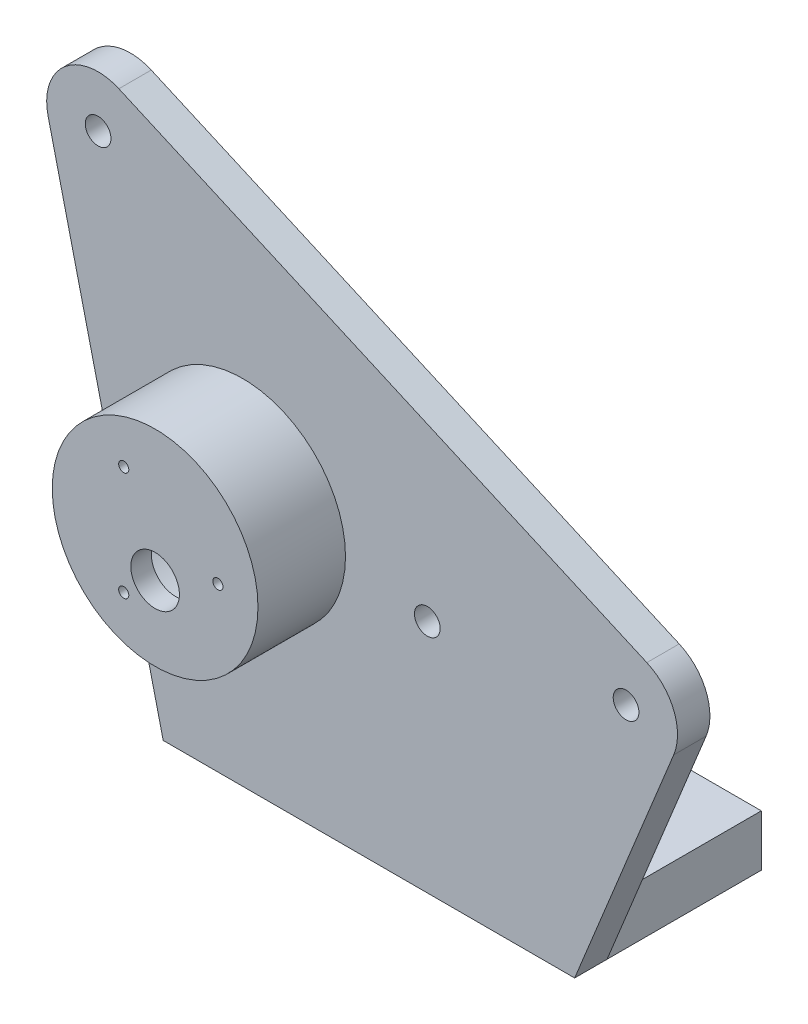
ISO-10303-21;
HEADER;
FILE_DESCRIPTION(('STEP AP214'),'2;1');
FILE_NAME('part.step','',(''),(''),'','','');
FILE_SCHEMA(('AUTOMOTIVE_DESIGN { 1 0 10303 214 1 1 1 1 }'));
ENDSEC;
DATA;
#1=APPLICATION_CONTEXT('core data for automotive mechanical design processes');
#2=APPLICATION_PROTOCOL_DEFINITION('international standard','automotive_design',2000,#1);
#3=PRODUCT_CONTEXT('',#1,'mechanical');
#4=PRODUCT('Part','Part','',(#3));
#5=PRODUCT_RELATED_PRODUCT_CATEGORY('part','',(#4));
#6=PRODUCT_DEFINITION_FORMATION('','',#4);
#7=PRODUCT_DEFINITION_CONTEXT('part definition',#1,'design');
#8=PRODUCT_DEFINITION('design','',#6,#7);
#9=PRODUCT_DEFINITION_SHAPE('','',#8);
#10=(LENGTH_UNIT() NAMED_UNIT(*) SI_UNIT(.MILLI.,.METRE.));
#11=(NAMED_UNIT(*) PLANE_ANGLE_UNIT() SI_UNIT($,.RADIAN.));
#12=(NAMED_UNIT(*) SI_UNIT($,.STERADIAN.) SOLID_ANGLE_UNIT());
#13=UNCERTAINTY_MEASURE_WITH_UNIT(LENGTH_MEASURE(1.E-05),#10,'distance_accuracy_value','');
#14=(GEOMETRIC_REPRESENTATION_CONTEXT(3) GLOBAL_UNCERTAINTY_ASSIGNED_CONTEXT((#13)) GLOBAL_UNIT_ASSIGNED_CONTEXT((#10,
#11,#12)) REPRESENTATION_CONTEXT('',''));
#15=CARTESIAN_POINT('',(0.,0.,0.));
#16=DIRECTION('',(0.,0.,1.));
#17=DIRECTION('',(1.,0.,0.));
#18=AXIS2_PLACEMENT_3D('',#15,#16,#17);
#19=CARTESIAN_POINT('',(0.,0.,-4.));
#20=DIRECTION('',(0.,0.,1.));
#21=DIRECTION('',(1.,0.,0.));
#22=AXIS2_PLACEMENT_3D('',#19,#20,#21);
#23=PLANE('',#22);
#24=CARTESIAN_POINT('',(-49.0816991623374,-6.64888767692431,-4.));
#25=DIRECTION('',(0.,0.,-1.));
#26=DIRECTION('',(-1.,0.,0.));
#27=AXIS2_PLACEMENT_3D('',#24,#25,#26);
#28=CIRCLE('',#27,3.1749999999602);
#29=CARTESIAN_POINT('',(-52.2566991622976,-6.64888767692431,-4.));
#30=VERTEX_POINT('',#29);
#31=EDGE_CURVE('E223',#30,#30,#28,.T.);
#32=ORIENTED_EDGE('',*,*,#31,.F.);
#33=EDGE_LOOP('',(#32));
#34=FACE_BOUND('',#33,.T.);
#35=CARTESIAN_POINT('',(-94.6851515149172,-2.91133055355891,-4.));
#36=DIRECTION('',(0.,0.,-1.));
#37=DIRECTION('',(-1.,0.,0.));
#38=AXIS2_PLACEMENT_3D('',#35,#36,#37);
#39=CIRCLE('',#38,20.32);
#40=CARTESIAN_POINT('',(-115.005151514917,-2.91133055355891,-4.));
#41=VERTEX_POINT('',#40);
#42=EDGE_CURVE('E220',#41,#41,#39,.T.);
#43=ORIENTED_EDGE('',*,*,#42,.F.);
#44=EDGE_LOOP('',(#43));
#45=FACE_BOUND('',#44,.T.);
#46=CARTESIAN_POINT('',(0.,0.,-4.));
#47=DIRECTION('',(0.,0.,1.));
#48=DIRECTION('',(1.,0.,0.));
#49=AXIS2_PLACEMENT_3D('',#46,#47,#48);
#50=CIRCLE('',#49,3.175);
#51=CARTESIAN_POINT('',(3.175,0.,-4.));
#52=VERTEX_POINT('',#51);
#53=EDGE_CURVE('E186',#52,#52,#50,.T.);
#54=ORIENTED_EDGE('',*,*,#53,.T.);
#55=EDGE_LOOP('',(#54));
#56=FACE_BOUND('',#55,.T.);
#57=CARTESIAN_POINT('',(-130.3782,57.531,-4.));
#58=DIRECTION('',(0.,0.,1.));
#59=DIRECTION('',(1.,0.,0.));
#60=AXIS2_PLACEMENT_3D('',#57,#58,#59);
#61=CIRCLE('',#60,3.175);
#62=CARTESIAN_POINT('',(-127.2032,57.531,-4.));
#63=VERTEX_POINT('',#62);
#64=EDGE_CURVE('E180',#63,#63,#61,.T.);
#65=ORIENTED_EDGE('',*,*,#64,.T.);
#66=EDGE_LOOP('',(#65));
#67=FACE_BOUND('',#66,.T.);
#68=DIRECTION('',(0.,-1.,0.));
#69=VECTOR('',#68,1.);
#70=CARTESIAN_POINT('',(-12.7,-64.7446,-4.));
#71=LINE('',#70,#69);
#72=CARTESIAN_POINT('',(-12.7,-52.0446,-4.));
#73=VERTEX_POINT('',#72);
#74=CARTESIAN_POINT('',(-12.7,-64.7446,-4.));
#75=VERTEX_POINT('',#74);
#76=EDGE_CURVE('E69',#73,#75,#71,.T.);
#77=ORIENTED_EDGE('',*,*,#76,.F.);
#78=DIRECTION('',(1.,0.,0.));
#79=VECTOR('',#78,1.);
#80=CARTESIAN_POINT('',(-12.7,-52.0446,-4.));
#81=LINE('',#80,#79);
#82=CARTESIAN_POINT('',(-114.3,-52.0446,-4.));
#83=VERTEX_POINT('',#82);
#84=EDGE_CURVE('E202',#83,#73,#81,.T.);
#85=ORIENTED_EDGE('',*,*,#84,.F.);
#86=DIRECTION('',(0.,1.,0.));
#87=VECTOR('',#86,1.);
#88=CARTESIAN_POINT('',(-114.3,-64.7446,-4.));
#89=LINE('',#88,#87);
#90=CARTESIAN_POINT('',(-114.3,-64.7446,-4.));
#91=VERTEX_POINT('',#90);
#92=EDGE_CURVE('E205',#91,#83,#89,.T.);
#93=ORIENTED_EDGE('',*,*,#92,.F.);
#94=DIRECTION('',(0.231774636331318,-0.972769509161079,0.));
#95=VECTOR('',#94,1.);
#96=CARTESIAN_POINT('',(-142.732372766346,54.5874621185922,-4.));
#97=LINE('',#96,#95);
#98=CARTESIAN_POINT('',(-142.732372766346,54.5874621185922,-4.));
#99=VERTEX_POINT('',#98);
#100=EDGE_CURVE('E140',#99,#91,#97,.T.);
#101=ORIENTED_EDGE('',*,*,#100,.F.);
#102=CARTESIAN_POINT('',(-130.3782,57.531,-4.));
#103=DIRECTION('',(0.,0.,1.));
#104=DIRECTION('',(1.,0.,0.));
#105=AXIS2_PLACEMENT_3D('',#102,#103,#104);
#106=CIRCLE('',#105,12.7);
#107=CARTESIAN_POINT('',(-125.25113344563,69.1500872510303,-4.));
#108=VERTEX_POINT('',#107);
#109=EDGE_CURVE('E160',#108,#99,#106,.T.);
#110=ORIENTED_EDGE('',*,*,#109,.F.);
#111=DIRECTION('',(-0.914888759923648,0.403706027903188,0.));
#112=VECTOR('',#111,1.);
#113=CARTESIAN_POINT('',(5.12706655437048,11.6190872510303,-4.));
#114=LINE('',#113,#112);
#115=CARTESIAN_POINT('',(5.12706655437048,11.6190872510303,-4.));
#116=VERTEX_POINT('',#115);
#117=EDGE_CURVE('E157',#116,#108,#114,.T.);
#118=ORIENTED_EDGE('',*,*,#117,.F.);
#119=CARTESIAN_POINT('',(0.,0.,-4.));
#120=DIRECTION('',(0.,0.,1.));
#121=DIRECTION('',(1.,0.,0.));
#122=AXIS2_PLACEMENT_3D('',#119,#120,#121);
#123=CIRCLE('',#122,12.7);
#124=CARTESIAN_POINT('',(11.75889689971,-4.79774360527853,-4.));
#125=VERTEX_POINT('',#124);
#126=EDGE_CURVE('E154',#125,#116,#123,.T.);
#127=ORIENTED_EDGE('',*,*,#126,.F.);
#128=DIRECTION('',(0.377775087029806,0.925897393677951,0.));
#129=VECTOR('',#128,1.);
#130=CARTESIAN_POINT('',(-12.7,-64.7446,-4.));
#131=LINE('',#130,#129);
#132=EDGE_CURVE('E103',#75,#125,#131,.T.);
#133=ORIENTED_EDGE('',*,*,#132,.F.);
#134=EDGE_LOOP('',(#77,#85,#93,#101,#110,#118,#127,#133));
#135=FACE_BOUND('',#134,.T.);
#136=ADVANCED_FACE('F53',(#34,#45,#56,#67,#135),#23,.F.);
#137=CARTESIAN_POINT('',(0.,0.,4.));
#138=DIRECTION('',(0.,0.,1.));
#139=DIRECTION('',(1.,0.,0.));
#140=AXIS2_PLACEMENT_3D('',#137,#138,#139);
#141=PLANE('',#140);
#142=CARTESIAN_POINT('',(-94.6851515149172,-2.91133055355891,4.));
#143=DIRECTION('',(0.,0.,1.));
#144=DIRECTION('',(1.,0.,0.));
#145=AXIS2_PLACEMENT_3D('',#142,#143,#144);
#146=CIRCLE('',#145,25.4);
#147=CARTESIAN_POINT('',(-69.2851515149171,-2.91133055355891,4.));
#148=VERTEX_POINT('',#147);
#149=EDGE_CURVE('E13',#148,#148,#146,.T.);
#150=ORIENTED_EDGE('',*,*,#149,.F.);
#151=EDGE_LOOP('',(#150));
#152=FACE_BOUND('',#151,.T.);
#153=CARTESIAN_POINT('',(-49.0816991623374,-6.64888767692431,4.));
#154=DIRECTION('',(0.,0.,1.));
#155=DIRECTION('',(1.,0.,0.));
#156=AXIS2_PLACEMENT_3D('',#153,#154,#155);
#157=CIRCLE('',#156,3.1749999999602);
#158=CARTESIAN_POINT('',(-45.9066991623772,-6.64888767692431,4.));
#159=VERTEX_POINT('',#158);
#160=EDGE_CURVE('E209',#159,#159,#157,.F.);
#161=ORIENTED_EDGE('',*,*,#160,.T.);
#162=EDGE_LOOP('',(#161));
#163=FACE_BOUND('',#162,.T.);
#164=CARTESIAN_POINT('',(-130.3782,57.531,4.));
#165=DIRECTION('',(0.,0.,1.));
#166=DIRECTION('',(1.,0.,0.));
#167=AXIS2_PLACEMENT_3D('',#164,#165,#166);
#168=CIRCLE('',#167,3.175);
#169=CARTESIAN_POINT('',(-127.2032,57.531,4.));
#170=VERTEX_POINT('',#169);
#171=EDGE_CURVE('E158',#170,#170,#168,.T.);
#172=ORIENTED_EDGE('',*,*,#171,.F.);
#173=EDGE_LOOP('',(#172));
#174=FACE_BOUND('',#173,.T.);
#175=CARTESIAN_POINT('',(0.,0.,4.));
#176=DIRECTION('',(0.,0.,1.));
#177=DIRECTION('',(1.,0.,0.));
#178=AXIS2_PLACEMENT_3D('',#175,#176,#177);
#179=CIRCLE('',#178,12.7);
#180=CARTESIAN_POINT('',(11.75889689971,-4.79774360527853,4.));
#181=VERTEX_POINT('',#180);
#182=CARTESIAN_POINT('',(5.12706655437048,11.6190872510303,4.));
#183=VERTEX_POINT('',#182);
#184=EDGE_CURVE('E164',#181,#183,#179,.T.);
#185=ORIENTED_EDGE('',*,*,#184,.T.);
#186=DIRECTION('',(-0.914888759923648,0.403706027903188,0.));
#187=VECTOR('',#186,1.);
#188=CARTESIAN_POINT('',(5.12706655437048,11.6190872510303,4.));
#189=LINE('',#188,#187);
#190=CARTESIAN_POINT('',(-125.25113344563,69.1500872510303,4.));
#191=VERTEX_POINT('',#190);
#192=EDGE_CURVE('E112',#183,#191,#189,.T.);
#193=ORIENTED_EDGE('',*,*,#192,.T.);
#194=CARTESIAN_POINT('',(-130.3782,57.531,4.));
#195=DIRECTION('',(0.,0.,1.));
#196=DIRECTION('',(1.,0.,0.));
#197=AXIS2_PLACEMENT_3D('',#194,#195,#196);
#198=CIRCLE('',#197,12.7);
#199=CARTESIAN_POINT('',(-142.732372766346,54.5874621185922,4.));
#200=VERTEX_POINT('',#199);
#201=EDGE_CURVE('E130',#191,#200,#198,.T.);
#202=ORIENTED_EDGE('',*,*,#201,.T.);
#203=DIRECTION('',(0.231774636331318,-0.972769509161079,0.));
#204=VECTOR('',#203,1.);
#205=CARTESIAN_POINT('',(-142.732372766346,54.5874621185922,4.));
#206=LINE('',#205,#204);
#207=CARTESIAN_POINT('',(-114.3,-64.7446,4.));
#208=VERTEX_POINT('',#207);
#209=EDGE_CURVE('E122',#200,#208,#206,.T.);
#210=ORIENTED_EDGE('',*,*,#209,.T.);
#211=DIRECTION('',(1.,0.,0.));
#212=VECTOR('',#211,1.);
#213=CARTESIAN_POINT('',(-114.3,-64.7446,4.));
#214=LINE('',#213,#212);
#215=CARTESIAN_POINT('',(-12.7,-64.7446,4.));
#216=VERTEX_POINT('',#215);
#217=EDGE_CURVE('E127',#208,#216,#214,.T.);
#218=ORIENTED_EDGE('',*,*,#217,.T.);
#219=DIRECTION('',(0.377775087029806,0.925897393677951,0.));
#220=VECTOR('',#219,1.);
#221=CARTESIAN_POINT('',(-12.7,-64.7446,4.));
#222=LINE('',#221,#220);
#223=EDGE_CURVE('E78',#216,#181,#222,.T.);
#224=ORIENTED_EDGE('',*,*,#223,.T.);
#225=EDGE_LOOP('',(#185,#193,#202,#210,#218,#224));
#226=FACE_BOUND('',#225,.T.);
#227=CARTESIAN_POINT('',(0.,0.,4.));
#228=DIRECTION('',(0.,0.,1.));
#229=DIRECTION('',(1.,0.,0.));
#230=AXIS2_PLACEMENT_3D('',#227,#228,#229);
#231=CIRCLE('',#230,3.175);
#232=CARTESIAN_POINT('',(3.175,0.,4.));
#233=VERTEX_POINT('',#232);
#234=EDGE_CURVE('E183',#233,#233,#231,.T.);
#235=ORIENTED_EDGE('',*,*,#234,.F.);
#236=EDGE_LOOP('',(#235));
#237=FACE_BOUND('',#236,.T.);
#238=ADVANCED_FACE('F124',(#152,#163,#174,#226,#237),#141,.T.);
#239=CARTESIAN_POINT('',(0.,0.,4.));
#240=DIRECTION('',(0.,0.,-1.));
#241=DIRECTION('',(-1.,0.,0.));
#242=AXIS2_PLACEMENT_3D('',#239,#240,#241);
#243=CYLINDRICAL_SURFACE('',#242,12.7);
#244=ORIENTED_EDGE('',*,*,#126,.T.);
#245=DIRECTION('',(0.,0.,-1.));
#246=VECTOR('',#245,1.);
#247=CARTESIAN_POINT('',(5.12706655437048,11.6190872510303,4.));
#248=LINE('',#247,#246);
#249=EDGE_CURVE('E57',#183,#116,#248,.T.);
#250=ORIENTED_EDGE('',*,*,#249,.F.);
#251=ORIENTED_EDGE('',*,*,#184,.F.);
#252=DIRECTION('',(0.,0.,-1.));
#253=VECTOR('',#252,1.);
#254=CARTESIAN_POINT('',(11.75889689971,-4.79774360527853,4.));
#255=LINE('',#254,#253);
#256=EDGE_CURVE('E150',#181,#125,#255,.T.);
#257=ORIENTED_EDGE('',*,*,#256,.T.);
#258=EDGE_LOOP('',(#244,#250,#251,#257));
#259=FACE_BOUND('',#258,.T.);
#260=ADVANCED_FACE('F55',(#259),#243,.T.);
#261=CARTESIAN_POINT('',(5.12706655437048,11.6190872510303,4.));
#262=DIRECTION('',(-0.403706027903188,-0.914888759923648,0.));
#263=DIRECTION('',(0.914888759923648,-0.403706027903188,0.));
#264=AXIS2_PLACEMENT_3D('',#261,#262,#263);
#265=PLANE('',#264);
#266=ORIENTED_EDGE('',*,*,#117,.T.);
#267=DIRECTION('',(0.,0.,-1.));
#268=VECTOR('',#267,1.);
#269=CARTESIAN_POINT('',(-125.25113344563,69.1500872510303,4.));
#270=LINE('',#269,#268);
#271=EDGE_CURVE('E167',#191,#108,#270,.T.);
#272=ORIENTED_EDGE('',*,*,#271,.F.);
#273=ORIENTED_EDGE('',*,*,#192,.F.);
#274=ORIENTED_EDGE('',*,*,#249,.T.);
#275=EDGE_LOOP('',(#266,#272,#273,#274));
#276=FACE_BOUND('',#275,.T.);
#277=ADVANCED_FACE('F172',(#276),#265,.F.);
#278=CARTESIAN_POINT('',(-130.3782,57.531,4.));
#279=DIRECTION('',(0.,0.,-1.));
#280=DIRECTION('',(-1.,0.,0.));
#281=AXIS2_PLACEMENT_3D('',#278,#279,#280);
#282=CYLINDRICAL_SURFACE('',#281,12.7);
#283=ORIENTED_EDGE('',*,*,#109,.T.);
#284=DIRECTION('',(0.,0.,-1.));
#285=VECTOR('',#284,1.);
#286=CARTESIAN_POINT('',(-142.732372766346,54.5874621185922,4.));
#287=LINE('',#286,#285);
#288=EDGE_CURVE('E144',#200,#99,#287,.T.);
#289=ORIENTED_EDGE('',*,*,#288,.F.);
#290=ORIENTED_EDGE('',*,*,#201,.F.);
#291=ORIENTED_EDGE('',*,*,#271,.T.);
#292=EDGE_LOOP('',(#283,#289,#290,#291));
#293=FACE_BOUND('',#292,.T.);
#294=ADVANCED_FACE('F176',(#293),#282,.T.);
#295=CARTESIAN_POINT('',(-142.732372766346,54.5874621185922,4.));
#296=DIRECTION('',(0.972769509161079,0.231774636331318,0.));
#297=DIRECTION('',(-0.231774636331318,0.972769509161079,0.));
#298=AXIS2_PLACEMENT_3D('',#295,#296,#297);
#299=PLANE('',#298);
#300=ORIENTED_EDGE('',*,*,#100,.T.);
#301=DIRECTION('',(0.,0.,-1.));
#302=VECTOR('',#301,1.);
#303=CARTESIAN_POINT('',(-114.3,-64.7446,4.));
#304=LINE('',#303,#302);
#305=EDGE_CURVE('E137',#208,#91,#304,.T.);
#306=ORIENTED_EDGE('',*,*,#305,.F.);
#307=ORIENTED_EDGE('',*,*,#209,.F.);
#308=ORIENTED_EDGE('',*,*,#288,.T.);
#309=EDGE_LOOP('',(#300,#306,#307,#308));
#310=FACE_BOUND('',#309,.T.);
#311=ADVANCED_FACE('F138',(#310),#299,.F.);
#312=CARTESIAN_POINT('',(-114.3,-64.7446,4.));
#313=DIRECTION('',(0.,1.,0.));
#314=DIRECTION('',(-1.,0.,0.));
#315=AXIS2_PLACEMENT_3D('',#312,#313,#314);
#316=PLANE('',#315);
#317=CARTESIAN_POINT('',(-19.304,-64.7446,-8.572));
#318=DIRECTION('',(0.,-1.,0.));
#319=DIRECTION('',(1.,0.,0.));
#320=AXIS2_PLACEMENT_3D('',#317,#318,#319);
#321=CIRCLE('',#320,2.54000000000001);
#322=CARTESIAN_POINT('',(-16.764,-64.7446,-8.572));
#323=VERTEX_POINT('',#322);
#324=EDGE_CURVE('E262',#323,#323,#321,.T.);
#325=ORIENTED_EDGE('',*,*,#324,.F.);
#326=EDGE_LOOP('',(#325));
#327=FACE_BOUND('',#326,.T.);
#328=CARTESIAN_POINT('',(-44.196,-64.7446,-33.464));
#329=DIRECTION('',(0.,-1.,0.));
#330=DIRECTION('',(1.,0.,0.));
#331=AXIS2_PLACEMENT_3D('',#328,#329,#330);
#332=CIRCLE('',#331,2.53999999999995);
#333=CARTESIAN_POINT('',(-41.656,-64.7446,-33.464));
#334=VERTEX_POINT('',#333);
#335=EDGE_CURVE('E263',#334,#334,#332,.T.);
#336=ORIENTED_EDGE('',*,*,#335,.F.);
#337=EDGE_LOOP('',(#336));
#338=FACE_BOUND('',#337,.T.);
#339=ORIENTED_EDGE('',*,*,#305,.T.);
#340=DIRECTION('',(0.,0.,1.));
#341=VECTOR('',#340,1.);
#342=CARTESIAN_POINT('',(-114.3,-64.7446,-42.1));
#343=LINE('',#342,#341);
#344=CARTESIAN_POINT('',(-114.3,-64.7446,-42.1));
#345=VERTEX_POINT('',#344);
#346=EDGE_CURVE('E193',#345,#91,#343,.T.);
#347=ORIENTED_EDGE('',*,*,#346,.F.);
#348=DIRECTION('',(-1.,0.,0.));
#349=VECTOR('',#348,1.);
#350=CARTESIAN_POINT('',(-12.7,-64.7446,-42.1));
#351=LINE('',#350,#349);
#352=CARTESIAN_POINT('',(-12.7,-64.7446,-42.1));
#353=VERTEX_POINT('',#352);
#354=EDGE_CURVE('E215',#353,#345,#351,.T.);
#355=ORIENTED_EDGE('',*,*,#354,.F.);
#356=DIRECTION('',(0.,0.,1.));
#357=VECTOR('',#356,1.);
#358=CARTESIAN_POINT('',(-12.7,-64.7446,-42.1));
#359=LINE('',#358,#357);
#360=EDGE_CURVE('E189',#353,#75,#359,.T.);
#361=ORIENTED_EDGE('',*,*,#360,.T.);
#362=DIRECTION('',(0.,0.,-1.));
#363=VECTOR('',#362,1.);
#364=CARTESIAN_POINT('',(-12.7,-64.7446,4.));
#365=LINE('',#364,#363);
#366=EDGE_CURVE('E145',#216,#75,#365,.T.);
#367=ORIENTED_EDGE('',*,*,#366,.F.);
#368=ORIENTED_EDGE('',*,*,#217,.F.);
#369=EDGE_LOOP('',(#339,#347,#355,#361,#367,#368));
#370=FACE_BOUND('',#369,.T.);
#371=ADVANCED_FACE('F147',(#327,#338,#370),#316,.F.);
#372=CARTESIAN_POINT('',(-12.7,-64.7446,4.));
#373=DIRECTION('',(-0.925897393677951,0.377775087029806,0.));
#374=DIRECTION('',(-0.377775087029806,-0.925897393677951,0.));
#375=AXIS2_PLACEMENT_3D('',#372,#373,#374);
#376=PLANE('',#375);
#377=ORIENTED_EDGE('',*,*,#132,.T.);
#378=ORIENTED_EDGE('',*,*,#256,.F.);
#379=ORIENTED_EDGE('',*,*,#223,.F.);
#380=ORIENTED_EDGE('',*,*,#366,.T.);
#381=EDGE_LOOP('',(#377,#378,#379,#380));
#382=FACE_BOUND('',#381,.T.);
#383=ADVANCED_FACE('F275',(#382),#376,.F.);
#384=CARTESIAN_POINT('',(-130.3782,57.531,4.));
#385=DIRECTION('',(0.,0.,-1.));
#386=DIRECTION('',(-1.,0.,0.));
#387=AXIS2_PLACEMENT_3D('',#384,#385,#386);
#388=CYLINDRICAL_SURFACE('',#387,3.175);
#389=ORIENTED_EDGE('',*,*,#171,.T.);
#390=EDGE_LOOP('',(#389));
#391=FACE_BOUND('',#390,.T.);
#392=ORIENTED_EDGE('',*,*,#64,.F.);
#393=EDGE_LOOP('',(#392));
#394=FACE_BOUND('',#393,.T.);
#395=ADVANCED_FACE('F306',(#391,#394),#388,.F.);
#396=CARTESIAN_POINT('',(0.,0.,4.));
#397=DIRECTION('',(0.,0.,-1.));
#398=DIRECTION('',(-1.,0.,0.));
#399=AXIS2_PLACEMENT_3D('',#396,#397,#398);
#400=CYLINDRICAL_SURFACE('',#399,3.175);
#401=ORIENTED_EDGE('',*,*,#234,.T.);
#402=EDGE_LOOP('',(#401));
#403=FACE_BOUND('',#402,.T.);
#404=ORIENTED_EDGE('',*,*,#53,.F.);
#405=EDGE_LOOP('',(#404));
#406=FACE_BOUND('',#405,.T.);
#407=ADVANCED_FACE('F349',(#403,#406),#400,.F.);
#408=CARTESIAN_POINT('',(-12.7,-64.7446,-42.1));
#409=DIRECTION('',(-1.,0.,0.));
#410=DIRECTION('',(0.,0.,1.));
#411=AXIS2_PLACEMENT_3D('',#408,#409,#410);
#412=PLANE('',#411);
#413=ORIENTED_EDGE('',*,*,#76,.T.);
#414=ORIENTED_EDGE('',*,*,#360,.F.);
#415=DIRECTION('',(0.,-1.,0.));
#416=VECTOR('',#415,1.);
#417=CARTESIAN_POINT('',(-12.7,-64.7446,-42.1));
#418=LINE('',#417,#416);
#419=CARTESIAN_POINT('',(-12.7,-52.0446,-42.1));
#420=VERTEX_POINT('',#419);
#421=EDGE_CURVE('E204',#420,#353,#418,.T.);
#422=ORIENTED_EDGE('',*,*,#421,.F.);
#423=DIRECTION('',(0.,0.,1.));
#424=VECTOR('',#423,1.);
#425=CARTESIAN_POINT('',(-12.7,-52.0446,-42.1));
#426=LINE('',#425,#424);
#427=EDGE_CURVE('E198',#420,#73,#426,.T.);
#428=ORIENTED_EDGE('',*,*,#427,.T.);
#429=EDGE_LOOP('',(#413,#414,#422,#428));
#430=FACE_BOUND('',#429,.T.);
#431=ADVANCED_FACE('F355',(#430),#412,.F.);
#432=CARTESIAN_POINT('',(-114.3,-64.7446,-42.1));
#433=DIRECTION('',(1.,0.,0.));
#434=DIRECTION('',(0.,0.,-1.));
#435=AXIS2_PLACEMENT_3D('',#432,#433,#434);
#436=PLANE('',#435);
#437=ORIENTED_EDGE('',*,*,#92,.T.);
#438=DIRECTION('',(0.,0.,1.));
#439=VECTOR('',#438,1.);
#440=CARTESIAN_POINT('',(-114.3,-52.0446,-42.1));
#441=LINE('',#440,#439);
#442=CARTESIAN_POINT('',(-114.3,-52.0446,-42.1));
#443=VERTEX_POINT('',#442);
#444=EDGE_CURVE('E195',#443,#83,#441,.T.);
#445=ORIENTED_EDGE('',*,*,#444,.F.);
#446=DIRECTION('',(0.,1.,0.));
#447=VECTOR('',#446,1.);
#448=CARTESIAN_POINT('',(-114.3,-64.7446,-42.1));
#449=LINE('',#448,#447);
#450=EDGE_CURVE('E212',#345,#443,#449,.T.);
#451=ORIENTED_EDGE('',*,*,#450,.F.);
#452=ORIENTED_EDGE('',*,*,#346,.T.);
#453=EDGE_LOOP('',(#437,#445,#451,#452));
#454=FACE_BOUND('',#453,.T.);
#455=ADVANCED_FACE('F364',(#454),#436,.F.);
#456=CARTESIAN_POINT('',(-12.7,-52.0446,-42.1));
#457=DIRECTION('',(0.,-1.,0.));
#458=DIRECTION('',(0.,0.,-1.));
#459=AXIS2_PLACEMENT_3D('',#456,#457,#458);
#460=PLANE('',#459);
#461=CARTESIAN_POINT('',(-19.304,-52.0446,-8.572));
#462=DIRECTION('',(0.,-1.,0.));
#463=DIRECTION('',(0.,0.,-1.));
#464=AXIS2_PLACEMENT_3D('',#461,#462,#463);
#465=CIRCLE('',#464,2.54000000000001);
#466=CARTESIAN_POINT('',(-16.764,-52.0446,-8.572));
#467=VERTEX_POINT('',#466);
#468=EDGE_CURVE('E256',#467,#467,#465,.F.);
#469=ORIENTED_EDGE('',*,*,#468,.F.);
#470=EDGE_LOOP('',(#469));
#471=FACE_BOUND('',#470,.T.);
#472=CARTESIAN_POINT('',(-44.196,-52.0446,-33.464));
#473=DIRECTION('',(0.,-1.,0.));
#474=DIRECTION('',(0.,0.,-1.));
#475=AXIS2_PLACEMENT_3D('',#472,#473,#474);
#476=CIRCLE('',#475,2.53999999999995);
#477=CARTESIAN_POINT('',(-41.656,-52.0446,-33.464));
#478=VERTEX_POINT('',#477);
#479=EDGE_CURVE('E259',#478,#478,#476,.F.);
#480=ORIENTED_EDGE('',*,*,#479,.F.);
#481=EDGE_LOOP('',(#480));
#482=FACE_BOUND('',#481,.T.);
#483=ORIENTED_EDGE('',*,*,#84,.T.);
#484=ORIENTED_EDGE('',*,*,#427,.F.);
#485=DIRECTION('',(1.,0.,0.));
#486=VECTOR('',#485,1.);
#487=CARTESIAN_POINT('',(-12.7,-52.0446,-42.1));
#488=LINE('',#487,#486);
#489=EDGE_CURVE('E201',#443,#420,#488,.T.);
#490=ORIENTED_EDGE('',*,*,#489,.F.);
#491=ORIENTED_EDGE('',*,*,#444,.T.);
#492=EDGE_LOOP('',(#483,#484,#490,#491));
#493=FACE_BOUND('',#492,.T.);
#494=ADVANCED_FACE('F372',(#471,#482,#493),#460,.F.);
#495=CARTESIAN_POINT('',(0.,0.,-42.1));
#496=DIRECTION('',(0.,0.,1.));
#497=DIRECTION('',(1.,0.,0.));
#498=AXIS2_PLACEMENT_3D('',#495,#496,#497);
#499=PLANE('',#498);
#500=ORIENTED_EDGE('',*,*,#421,.T.);
#501=ORIENTED_EDGE('',*,*,#354,.T.);
#502=ORIENTED_EDGE('',*,*,#450,.T.);
#503=ORIENTED_EDGE('',*,*,#489,.T.);
#504=EDGE_LOOP('',(#500,#501,#502,#503));
#505=FACE_BOUND('',#504,.T.);
#506=ADVANCED_FACE('F380',(#505),#499,.F.);
#507=CARTESIAN_POINT('',(-94.6851515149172,-2.91133055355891,61.4736391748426));
#508=DIRECTION('',(0.,0.,-1.));
#509=DIRECTION('',(-1.,0.,0.));
#510=AXIS2_PLACEMENT_3D('',#507,#508,#509);
#511=CYLINDRICAL_SURFACE('',#510,20.32);
#512=ORIENTED_EDGE('',*,*,#42,.T.);
#513=EDGE_LOOP('',(#512));
#514=FACE_BOUND('',#513,.T.);
#515=CARTESIAN_POINT('',(-94.6851515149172,-2.91133055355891,20.5338000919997));
#516=DIRECTION('',(0.,0.,-1.));
#517=DIRECTION('',(-1.,0.,0.));
#518=AXIS2_PLACEMENT_3D('',#515,#516,#517);
#519=CIRCLE('',#518,20.32);
#520=CARTESIAN_POINT('',(-115.005151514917,-2.91133055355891,20.5338000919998));
#521=VERTEX_POINT('',#520);
#522=EDGE_CURVE('E224',#521,#521,#519,.T.);
#523=ORIENTED_EDGE('',*,*,#522,.F.);
#524=EDGE_LOOP('',(#523));
#525=FACE_BOUND('',#524,.T.);
#526=ADVANCED_FACE('F388',(#514,#525),#511,.F.);
#527=CARTESIAN_POINT('',(-49.0816991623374,-6.64888767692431,61.4736391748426));
#528=DIRECTION('',(0.,0.,-1.));
#529=DIRECTION('',(-1.,0.,0.));
#530=AXIS2_PLACEMENT_3D('',#527,#528,#529);
#531=CYLINDRICAL_SURFACE('',#530,3.1749999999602);
#532=ORIENTED_EDGE('',*,*,#31,.T.);
#533=EDGE_LOOP('',(#532));
#534=FACE_BOUND('',#533,.T.);
#535=ORIENTED_EDGE('',*,*,#160,.F.);
#536=EDGE_LOOP('',(#535));
#537=FACE_BOUND('',#536,.T.);
#538=ADVANCED_FACE('F397',(#534,#537),#531,.F.);
#539=CARTESIAN_POINT('',(-94.6851515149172,-2.91133055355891,92.375849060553));
#540=DIRECTION('',(0.,0.,-1.));
#541=DIRECTION('',(-1.,0.,0.));
#542=AXIS2_PLACEMENT_3D('',#539,#540,#541);
#543=CYLINDRICAL_SURFACE('',#542,25.4);
#544=ORIENTED_EDGE('',*,*,#149,.T.);
#545=EDGE_LOOP('',(#544));
#546=FACE_BOUND('',#545,.T.);
#547=CARTESIAN_POINT('',(-94.6851515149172,-2.91133055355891,25.6138000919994));
#548=DIRECTION('',(0.,0.,1.));
#549=DIRECTION('',(1.,0.,0.));
#550=AXIS2_PLACEMENT_3D('',#547,#548,#549);
#551=CIRCLE('',#550,25.4);
#552=CARTESIAN_POINT('',(-69.2851515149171,-2.91133055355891,25.6138000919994));
#553=VERTEX_POINT('',#552);
#554=EDGE_CURVE('E230',#553,#553,#551,.T.);
#555=ORIENTED_EDGE('',*,*,#554,.F.);
#556=EDGE_LOOP('',(#555));
#557=FACE_BOUND('',#556,.T.);
#558=ADVANCED_FACE('F406',(#546,#557),#543,.T.);
#559=CARTESIAN_POINT('',(-94.6851515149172,-2.91133055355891,20.5338000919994));
#560=DIRECTION('',(0.,0.,1.));
#561=DIRECTION('',(1.,0.,0.));
#562=AXIS2_PLACEMENT_3D('',#559,#560,#561);
#563=PLANE('',#562);
#564=CARTESIAN_POINT('',(-94.6851515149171,-9.91133055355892,20.5338000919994));
#565=DIRECTION('',(0.,0.,1.));
#566=DIRECTION('',(1.,0.,0.));
#567=AXIS2_PLACEMENT_3D('',#564,#565,#566);
#568=CIRCLE('',#567,5.99999999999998);
#569=CARTESIAN_POINT('',(-88.6851515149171,-9.91133055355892,20.5338000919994));
#570=VERTEX_POINT('',#569);
#571=EDGE_CURVE('E253',#570,#570,#568,.T.);
#572=ORIENTED_EDGE('',*,*,#571,.T.);
#573=EDGE_LOOP('',(#572));
#574=FACE_BOUND('',#573,.T.);
#575=CARTESIAN_POINT('',(-79.1851515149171,-2.91133055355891,20.5338000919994));
#576=DIRECTION('',(0.,0.,1.));
#577=DIRECTION('',(1.,0.,0.));
#578=AXIS2_PLACEMENT_3D('',#575,#576,#577);
#579=CIRCLE('',#578,1.24999999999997);
#580=CARTESIAN_POINT('',(-77.9351515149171,-2.91133055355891,20.5338000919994));
#581=VERTEX_POINT('',#580);
#582=EDGE_CURVE('E247',#581,#581,#579,.T.);
#583=ORIENTED_EDGE('',*,*,#582,.T.);
#584=EDGE_LOOP('',(#583));
#585=FACE_BOUND('',#584,.T.);
#586=CARTESIAN_POINT('',(-102.435151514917,10.5120632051,20.5338000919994));
#587=DIRECTION('',(0.,0.,1.));
#588=DIRECTION('',(1.,0.,0.));
#589=AXIS2_PLACEMENT_3D('',#586,#587,#588);
#590=CIRCLE('',#589,1.24999999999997);
#591=CARTESIAN_POINT('',(-101.185151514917,10.5120632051,20.5338000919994));
#592=VERTEX_POINT('',#591);
#593=EDGE_CURVE('E241',#592,#592,#590,.T.);
#594=ORIENTED_EDGE('',*,*,#593,.T.);
#595=EDGE_LOOP('',(#594));
#596=FACE_BOUND('',#595,.T.);
#597=CARTESIAN_POINT('',(-102.435151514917,-16.3347243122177,20.5338000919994));
#598=DIRECTION('',(0.,0.,1.));
#599=DIRECTION('',(1.,0.,0.));
#600=AXIS2_PLACEMENT_3D('',#597,#598,#599);
#601=CIRCLE('',#600,1.24999999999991);
#602=CARTESIAN_POINT('',(-101.185151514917,-16.3347243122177,20.5338000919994));
#603=VERTEX_POINT('',#602);
#604=EDGE_CURVE('E235',#603,#603,#601,.T.);
#605=ORIENTED_EDGE('',*,*,#604,.T.);
#606=EDGE_LOOP('',(#605));
#607=FACE_BOUND('',#606,.T.);
#608=ORIENTED_EDGE('',*,*,#522,.T.);
#609=EDGE_LOOP('',(#608));
#610=FACE_BOUND('',#609,.T.);
#611=ADVANCED_FACE('F414',(#574,#585,#596,#607,#610),#563,.F.);
#612=CARTESIAN_POINT('',(-94.6851515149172,-2.91133055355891,25.6138000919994));
#613=DIRECTION('',(0.,0.,1.));
#614=DIRECTION('',(1.,0.,0.));
#615=AXIS2_PLACEMENT_3D('',#612,#613,#614);
#616=PLANE('',#615);
#617=CARTESIAN_POINT('',(-79.1851515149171,-2.91133055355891,25.6138000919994));
#618=DIRECTION('',(0.,0.,1.));
#619=DIRECTION('',(1.,0.,0.));
#620=AXIS2_PLACEMENT_3D('',#617,#618,#619);
#621=CIRCLE('',#620,1.24999999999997);
#622=CARTESIAN_POINT('',(-77.9351515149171,-2.91133055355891,25.6138000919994));
#623=VERTEX_POINT('',#622);
#624=EDGE_CURVE('E244',#623,#623,#621,.T.);
#625=ORIENTED_EDGE('',*,*,#624,.F.);
#626=EDGE_LOOP('',(#625));
#627=FACE_BOUND('',#626,.T.);
#628=CARTESIAN_POINT('',(-102.435151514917,-16.3347243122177,25.6138000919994));
#629=DIRECTION('',(0.,0.,1.));
#630=DIRECTION('',(1.,0.,0.));
#631=AXIS2_PLACEMENT_3D('',#628,#629,#630);
#632=CIRCLE('',#631,1.24999999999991);
#633=CARTESIAN_POINT('',(-101.185151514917,-16.3347243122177,25.6138000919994));
#634=VERTEX_POINT('',#633);
#635=EDGE_CURVE('E234',#634,#634,#632,.T.);
#636=ORIENTED_EDGE('',*,*,#635,.F.);
#637=EDGE_LOOP('',(#636));
#638=FACE_BOUND('',#637,.T.);
#639=ORIENTED_EDGE('',*,*,#554,.T.);
#640=EDGE_LOOP('',(#639));
#641=FACE_BOUND('',#640,.T.);
#642=CARTESIAN_POINT('',(-102.435151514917,10.5120632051,25.6138000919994));
#643=DIRECTION('',(0.,0.,1.));
#644=DIRECTION('',(1.,0.,0.));
#645=AXIS2_PLACEMENT_3D('',#642,#643,#644);
#646=CIRCLE('',#645,1.24999999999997);
#647=CARTESIAN_POINT('',(-101.185151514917,10.5120632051,25.6138000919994));
#648=VERTEX_POINT('',#647);
#649=EDGE_CURVE('E238',#648,#648,#646,.T.);
#650=ORIENTED_EDGE('',*,*,#649,.F.);
#651=EDGE_LOOP('',(#650));
#652=FACE_BOUND('',#651,.T.);
#653=CARTESIAN_POINT('',(-94.6851515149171,-9.91133055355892,25.6138000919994));
#654=DIRECTION('',(0.,0.,1.));
#655=DIRECTION('',(1.,0.,0.));
#656=AXIS2_PLACEMENT_3D('',#653,#654,#655);
#657=CIRCLE('',#656,5.99999999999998);
#658=CARTESIAN_POINT('',(-88.6851515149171,-9.91133055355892,25.6138000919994));
#659=VERTEX_POINT('',#658);
#660=EDGE_CURVE('E250',#659,#659,#657,.T.);
#661=ORIENTED_EDGE('',*,*,#660,.F.);
#662=EDGE_LOOP('',(#661));
#663=FACE_BOUND('',#662,.T.);
#664=ADVANCED_FACE('F422',(#627,#638,#641,#652,#663),#616,.T.);
#665=CARTESIAN_POINT('',(-102.435151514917,-16.3347243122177,25.6138000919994));
#666=DIRECTION('',(0.,0.,-1.));
#667=DIRECTION('',(-1.,0.,0.));
#668=AXIS2_PLACEMENT_3D('',#665,#666,#667);
#669=CYLINDRICAL_SURFACE('',#668,1.24999999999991);
#670=ORIENTED_EDGE('',*,*,#635,.T.);
#671=EDGE_LOOP('',(#670));
#672=FACE_BOUND('',#671,.T.);
#673=ORIENTED_EDGE('',*,*,#604,.F.);
#674=EDGE_LOOP('',(#673));
#675=FACE_BOUND('',#674,.T.);
#676=ADVANCED_FACE('F430',(#672,#675),#669,.F.);
#677=CARTESIAN_POINT('',(-102.435151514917,10.5120632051,25.6138000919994));
#678=DIRECTION('',(0.,0.,-1.));
#679=DIRECTION('',(-1.,0.,0.));
#680=AXIS2_PLACEMENT_3D('',#677,#678,#679);
#681=CYLINDRICAL_SURFACE('',#680,1.24999999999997);
#682=ORIENTED_EDGE('',*,*,#649,.T.);
#683=EDGE_LOOP('',(#682));
#684=FACE_BOUND('',#683,.T.);
#685=ORIENTED_EDGE('',*,*,#593,.F.);
#686=EDGE_LOOP('',(#685));
#687=FACE_BOUND('',#686,.T.);
#688=ADVANCED_FACE('F438',(#684,#687),#681,.F.);
#689=CARTESIAN_POINT('',(-79.1851515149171,-2.91133055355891,25.6138000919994));
#690=DIRECTION('',(0.,0.,-1.));
#691=DIRECTION('',(-1.,0.,0.));
#692=AXIS2_PLACEMENT_3D('',#689,#690,#691);
#693=CYLINDRICAL_SURFACE('',#692,1.24999999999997);
#694=ORIENTED_EDGE('',*,*,#624,.T.);
#695=EDGE_LOOP('',(#694));
#696=FACE_BOUND('',#695,.T.);
#697=ORIENTED_EDGE('',*,*,#582,.F.);
#698=EDGE_LOOP('',(#697));
#699=FACE_BOUND('',#698,.T.);
#700=ADVANCED_FACE('F290',(#696,#699),#693,.F.);
#701=CARTESIAN_POINT('',(-94.6851515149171,-9.91133055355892,25.6138000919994));
#702=DIRECTION('',(0.,0.,-1.));
#703=DIRECTION('',(-1.,0.,0.));
#704=AXIS2_PLACEMENT_3D('',#701,#702,#703);
#705=CYLINDRICAL_SURFACE('',#704,5.99999999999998);
#706=ORIENTED_EDGE('',*,*,#660,.T.);
#707=EDGE_LOOP('',(#706));
#708=FACE_BOUND('',#707,.T.);
#709=ORIENTED_EDGE('',*,*,#571,.F.);
#710=EDGE_LOOP('',(#709));
#711=FACE_BOUND('',#710,.T.);
#712=ADVANCED_FACE('F281',(#708,#711),#705,.F.);
#713=CARTESIAN_POINT('',(-44.196,-44.8603951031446,-33.464));
#714=DIRECTION('',(0.,-1.,0.));
#715=DIRECTION('',(1.,0.,0.));
#716=AXIS2_PLACEMENT_3D('',#713,#714,#715);
#717=CYLINDRICAL_SURFACE('',#716,2.53999999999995);
#718=CARTESIAN_POINT('',(-41.656,-52.0446,-33.464));
#719=CARTESIAN_POINT('',(-41.656,-52.1768916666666,-33.464));
#720=CARTESIAN_POINT('',(-41.656,-52.3091833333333,-33.464));
#721=CARTESIAN_POINT('',(-41.656,-52.5737666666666,-33.464));
#722=CARTESIAN_POINT('',(-41.656,-52.7060583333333,-33.464));
#723=CARTESIAN_POINT('',(-41.656,-52.9706416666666,-33.464));
#724=CARTESIAN_POINT('',(-41.656,-53.1029333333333,-33.464));
#725=CARTESIAN_POINT('',(-41.656,-53.3675166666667,-33.464));
#726=CARTESIAN_POINT('',(-41.656,-53.4998083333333,-33.464));
#727=CARTESIAN_POINT('',(-41.656,-53.7643916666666,-33.464));
#728=CARTESIAN_POINT('',(-41.656,-53.8966833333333,-33.464));
#729=CARTESIAN_POINT('',(-41.656,-54.1612666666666,-33.464));
#730=CARTESIAN_POINT('',(-41.656,-54.2935583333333,-33.464));
#731=CARTESIAN_POINT('',(-41.656,-54.5581416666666,-33.464));
#732=CARTESIAN_POINT('',(-41.656,-54.6904333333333,-33.464));
#733=CARTESIAN_POINT('',(-41.656,-54.9550166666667,-33.464));
#734=CARTESIAN_POINT('',(-41.656,-55.0873083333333,-33.464));
#735=CARTESIAN_POINT('',(-41.656,-55.3518916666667,-33.464));
#736=CARTESIAN_POINT('',(-41.656,-55.4841833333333,-33.464));
#737=CARTESIAN_POINT('',(-41.656,-55.7487666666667,-33.464));
#738=CARTESIAN_POINT('',(-41.656,-55.8810583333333,-33.464));
#739=CARTESIAN_POINT('',(-41.656,-56.1456416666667,-33.464));
#740=CARTESIAN_POINT('',(-41.656,-56.2779333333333,-33.464));
#741=CARTESIAN_POINT('',(-41.656,-56.5425166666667,-33.464));
#742=CARTESIAN_POINT('',(-41.656,-56.6748083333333,-33.464));
#743=CARTESIAN_POINT('',(-41.656,-56.9393916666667,-33.464));
#744=CARTESIAN_POINT('',(-41.656,-57.0716833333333,-33.464));
#745=CARTESIAN_POINT('',(-41.656,-57.3362666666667,-33.464));
#746=CARTESIAN_POINT('',(-41.656,-57.4685583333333,-33.464));
#747=CARTESIAN_POINT('',(-41.656,-57.7331416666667,-33.464));
#748=CARTESIAN_POINT('',(-41.656,-57.8654333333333,-33.464));
#749=CARTESIAN_POINT('',(-41.656,-58.1300166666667,-33.464));
#750=CARTESIAN_POINT('',(-41.656,-58.2623083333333,-33.464));
#751=CARTESIAN_POINT('',(-41.656,-58.5268916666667,-33.464));
#752=CARTESIAN_POINT('',(-41.656,-58.6591833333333,-33.464));
#753=CARTESIAN_POINT('',(-41.656,-58.9237666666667,-33.464));
#754=CARTESIAN_POINT('',(-41.656,-59.0560583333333,-33.464));
#755=CARTESIAN_POINT('',(-41.656,-59.3206416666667,-33.464));
#756=CARTESIAN_POINT('',(-41.656,-59.4529333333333,-33.464));
#757=CARTESIAN_POINT('',(-41.656,-59.7175166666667,-33.464));
#758=CARTESIAN_POINT('',(-41.656,-59.8498083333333,-33.464));
#759=CARTESIAN_POINT('',(-41.656,-60.1143916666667,-33.464));
#760=CARTESIAN_POINT('',(-41.656,-60.2466833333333,-33.464));
#761=CARTESIAN_POINT('',(-41.656,-60.5112666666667,-33.464));
#762=CARTESIAN_POINT('',(-41.656,-60.6435583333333,-33.464));
#763=CARTESIAN_POINT('',(-41.656,-60.9081416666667,-33.464));
#764=CARTESIAN_POINT('',(-41.656,-61.0404333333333,-33.464));
#765=CARTESIAN_POINT('',(-41.656,-61.3050166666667,-33.464));
#766=CARTESIAN_POINT('',(-41.656,-61.4373083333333,-33.464));
#767=CARTESIAN_POINT('',(-41.656,-61.7018916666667,-33.464));
#768=CARTESIAN_POINT('',(-41.656,-61.8341833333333,-33.464));
#769=CARTESIAN_POINT('',(-41.656,-62.0987666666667,-33.464));
#770=CARTESIAN_POINT('',(-41.656,-62.2310583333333,-33.464));
#771=CARTESIAN_POINT('',(-41.656,-62.4956416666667,-33.464));
#772=CARTESIAN_POINT('',(-41.656,-62.6279333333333,-33.464));
#773=CARTESIAN_POINT('',(-41.656,-62.8925166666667,-33.464));
#774=CARTESIAN_POINT('',(-41.656,-63.0248083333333,-33.464));
#775=CARTESIAN_POINT('',(-41.656,-63.2893916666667,-33.464));
#776=CARTESIAN_POINT('',(-41.656,-63.4216833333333,-33.464));
#777=CARTESIAN_POINT('',(-41.656,-63.6862666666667,-33.464));
#778=CARTESIAN_POINT('',(-41.656,-63.8185583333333,-33.464));
#779=CARTESIAN_POINT('',(-41.656,-64.0831416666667,-33.464));
#780=CARTESIAN_POINT('',(-41.656,-64.2154333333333,-33.464));
#781=CARTESIAN_POINT('',(-41.656,-64.4800166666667,-33.464));
#782=CARTESIAN_POINT('',(-41.656,-64.6123083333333,-33.464));
#783=CARTESIAN_POINT('',(-41.656,-64.7446,-33.464));
#784=B_SPLINE_CURVE_WITH_KNOTS('',3,(#718,#719,#720,#721,#722,#723,#724,#725,#726,#727,#728,
#729,#730,#731,#732,#733,#734,#735,#736,#737,#738,#739,#740,#741,#742,#743,#744,#745,#746,#747,
#748,#749,#750,#751,#752,#753,#754,#755,#756,#757,#758,#759,#760,#761,#762,#763,#764,#765,#766,
#767,#768,#769,#770,#771,#772,#773,#774,#775,#776,#777,#778,#779,#780,#781,#782,#783),
.UNSPECIFIED.,.F.,.F.,(4,2,2,2,2,2,2,2,2,2,2,2,2,2,2,2,2,2,2,2,2,2,2,2,2,2,2,2,2,2,2,2,4),(0.,
0.396875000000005,0.793750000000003,1.19062500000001,1.58750000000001,1.984375,2.38125000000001,
2.77812500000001,3.17500000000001,3.57187500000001,3.96875000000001,4.36562500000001,
4.76250000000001,5.15937500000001,5.55625000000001,5.95312500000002,6.35000000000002,
6.74687500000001,7.14375000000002,7.54062500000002,7.93750000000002,8.33437500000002,
8.73125000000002,9.12812500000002,9.52500000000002,9.92187500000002,10.31875,10.715625,11.1125,
11.509375,11.90625,12.303125,12.7),.UNSPECIFIED.);
#785=EDGE_CURVE('BSEAM279',#478,#334,#784,.T.);
#786=ORIENTED_EDGE('',*,*,#479,.T.);
#787=ORIENTED_EDGE('',*,*,#335,.T.);
#788=ORIENTED_EDGE('',*,*,#785,.T.);
#789=ORIENTED_EDGE('',*,*,#785,.F.);
#790=EDGE_LOOP('',(#786,#788,#787,#789));
#791=FACE_BOUND('',#790,.T.);
#792=ADVANCED_FACE('F279',(#791),#717,.F.);
#793=CARTESIAN_POINT('',(-19.304,-44.8603951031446,-8.572));
#794=DIRECTION('',(0.,-1.,0.));
#795=DIRECTION('',(1.,0.,0.));
#796=AXIS2_PLACEMENT_3D('',#793,#794,#795);
#797=CYLINDRICAL_SURFACE('',#796,2.54000000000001);
#798=CARTESIAN_POINT('',(-16.764,-52.0446,-8.572));
#799=CARTESIAN_POINT('',(-16.764,-52.1768916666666,-8.572));
#800=CARTESIAN_POINT('',(-16.764,-52.3091833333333,-8.572));
#801=CARTESIAN_POINT('',(-16.764,-52.5737666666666,-8.572));
#802=CARTESIAN_POINT('',(-16.764,-52.7060583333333,-8.572));
#803=CARTESIAN_POINT('',(-16.764,-52.9706416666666,-8.572));
#804=CARTESIAN_POINT('',(-16.764,-53.1029333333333,-8.572));
#805=CARTESIAN_POINT('',(-16.764,-53.3675166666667,-8.572));
#806=CARTESIAN_POINT('',(-16.764,-53.4998083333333,-8.572));
#807=CARTESIAN_POINT('',(-16.764,-53.7643916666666,-8.572));
#808=CARTESIAN_POINT('',(-16.764,-53.8966833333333,-8.572));
#809=CARTESIAN_POINT('',(-16.764,-54.1612666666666,-8.572));
#810=CARTESIAN_POINT('',(-16.764,-54.2935583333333,-8.572));
#811=CARTESIAN_POINT('',(-16.764,-54.5581416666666,-8.572));
#812=CARTESIAN_POINT('',(-16.764,-54.6904333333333,-8.572));
#813=CARTESIAN_POINT('',(-16.764,-54.9550166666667,-8.572));
#814=CARTESIAN_POINT('',(-16.764,-55.0873083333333,-8.572));
#815=CARTESIAN_POINT('',(-16.764,-55.3518916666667,-8.572));
#816=CARTESIAN_POINT('',(-16.764,-55.4841833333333,-8.572));
#817=CARTESIAN_POINT('',(-16.764,-55.7487666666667,-8.572));
#818=CARTESIAN_POINT('',(-16.764,-55.8810583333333,-8.572));
#819=CARTESIAN_POINT('',(-16.764,-56.1456416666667,-8.572));
#820=CARTESIAN_POINT('',(-16.764,-56.2779333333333,-8.572));
#821=CARTESIAN_POINT('',(-16.764,-56.5425166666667,-8.572));
#822=CARTESIAN_POINT('',(-16.764,-56.6748083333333,-8.572));
#823=CARTESIAN_POINT('',(-16.764,-56.9393916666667,-8.572));
#824=CARTESIAN_POINT('',(-16.764,-57.0716833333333,-8.572));
#825=CARTESIAN_POINT('',(-16.764,-57.3362666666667,-8.572));
#826=CARTESIAN_POINT('',(-16.764,-57.4685583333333,-8.572));
#827=CARTESIAN_POINT('',(-16.764,-57.7331416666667,-8.572));
#828=CARTESIAN_POINT('',(-16.764,-57.8654333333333,-8.572));
#829=CARTESIAN_POINT('',(-16.764,-58.1300166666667,-8.572));
#830=CARTESIAN_POINT('',(-16.764,-58.2623083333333,-8.572));
#831=CARTESIAN_POINT('',(-16.764,-58.5268916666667,-8.572));
#832=CARTESIAN_POINT('',(-16.764,-58.6591833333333,-8.572));
#833=CARTESIAN_POINT('',(-16.764,-58.9237666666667,-8.572));
#834=CARTESIAN_POINT('',(-16.764,-59.0560583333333,-8.572));
#835=CARTESIAN_POINT('',(-16.764,-59.3206416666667,-8.572));
#836=CARTESIAN_POINT('',(-16.764,-59.4529333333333,-8.572));
#837=CARTESIAN_POINT('',(-16.764,-59.7175166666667,-8.572));
#838=CARTESIAN_POINT('',(-16.764,-59.8498083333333,-8.572));
#839=CARTESIAN_POINT('',(-16.764,-60.1143916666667,-8.572));
#840=CARTESIAN_POINT('',(-16.764,-60.2466833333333,-8.572));
#841=CARTESIAN_POINT('',(-16.764,-60.5112666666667,-8.572));
#842=CARTESIAN_POINT('',(-16.764,-60.6435583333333,-8.572));
#843=CARTESIAN_POINT('',(-16.764,-60.9081416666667,-8.572));
#844=CARTESIAN_POINT('',(-16.764,-61.0404333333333,-8.572));
#845=CARTESIAN_POINT('',(-16.764,-61.3050166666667,-8.572));
#846=CARTESIAN_POINT('',(-16.764,-61.4373083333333,-8.572));
#847=CARTESIAN_POINT('',(-16.764,-61.7018916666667,-8.572));
#848=CARTESIAN_POINT('',(-16.764,-61.8341833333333,-8.572));
#849=CARTESIAN_POINT('',(-16.764,-62.0987666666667,-8.572));
#850=CARTESIAN_POINT('',(-16.764,-62.2310583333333,-8.572));
#851=CARTESIAN_POINT('',(-16.764,-62.4956416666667,-8.572));
#852=CARTESIAN_POINT('',(-16.764,-62.6279333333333,-8.572));
#853=CARTESIAN_POINT('',(-16.764,-62.8925166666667,-8.572));
#854=CARTESIAN_POINT('',(-16.764,-63.0248083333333,-8.572));
#855=CARTESIAN_POINT('',(-16.764,-63.2893916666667,-8.572));
#856=CARTESIAN_POINT('',(-16.764,-63.4216833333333,-8.572));
#857=CARTESIAN_POINT('',(-16.764,-63.6862666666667,-8.572));
#858=CARTESIAN_POINT('',(-16.764,-63.8185583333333,-8.572));
#859=CARTESIAN_POINT('',(-16.764,-64.0831416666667,-8.572));
#860=CARTESIAN_POINT('',(-16.764,-64.2154333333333,-8.572));
#861=CARTESIAN_POINT('',(-16.764,-64.4800166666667,-8.572));
#862=CARTESIAN_POINT('',(-16.764,-64.6123083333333,-8.572));
#863=CARTESIAN_POINT('',(-16.764,-64.7446,-8.572));
#864=B_SPLINE_CURVE_WITH_KNOTS('',3,(#798,#799,#800,#801,#802,#803,#804,#805,#806,#807,#808,
#809,#810,#811,#812,#813,#814,#815,#816,#817,#818,#819,#820,#821,#822,#823,#824,#825,#826,#827,
#828,#829,#830,#831,#832,#833,#834,#835,#836,#837,#838,#839,#840,#841,#842,#843,#844,#845,#846,
#847,#848,#849,#850,#851,#852,#853,#854,#855,#856,#857,#858,#859,#860,#861,#862,#863),
.UNSPECIFIED.,.F.,.F.,(4,2,2,2,2,2,2,2,2,2,2,2,2,2,2,2,2,2,2,2,2,2,2,2,2,2,2,2,2,2,2,2,4),(0.,
0.396875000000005,0.793750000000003,1.19062500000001,1.58750000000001,1.984375,2.38125000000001,
2.77812500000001,3.17500000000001,3.57187500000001,3.96875000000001,4.36562500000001,
4.76250000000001,5.15937500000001,5.55625000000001,5.95312500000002,6.35000000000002,
6.74687500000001,7.14375000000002,7.54062500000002,7.93750000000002,8.33437500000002,
8.73125000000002,9.12812500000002,9.52500000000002,9.92187500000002,10.31875,10.715625,11.1125,
11.509375,11.90625,12.303125,12.7),.UNSPECIFIED.);
#865=EDGE_CURVE('BSEAM271',#467,#323,#864,.T.);
#866=ORIENTED_EDGE('',*,*,#468,.T.);
#867=ORIENTED_EDGE('',*,*,#324,.T.);
#868=ORIENTED_EDGE('',*,*,#865,.T.);
#869=ORIENTED_EDGE('',*,*,#865,.F.);
#870=EDGE_LOOP('',(#866,#868,#867,#869));
#871=FACE_BOUND('',#870,.T.);
#872=ADVANCED_FACE('F271',(#871),#797,.F.);
#873=CLOSED_SHELL('',(#136,#238,#260,#277,#294,#311,#371,#383,#395,#407,#431,#455,#494,#506,
#526,#538,#558,#611,#664,#676,#688,#700,#712,#792,#872));
#874=MANIFOLD_SOLID_BREP('B2',#873);
#875=ADVANCED_BREP_SHAPE_REPRESENTATION('',(#18,#874),#14);
#876=SHAPE_DEFINITION_REPRESENTATION(#9,#875);
ENDSEC;
END-ISO-10303-21;
